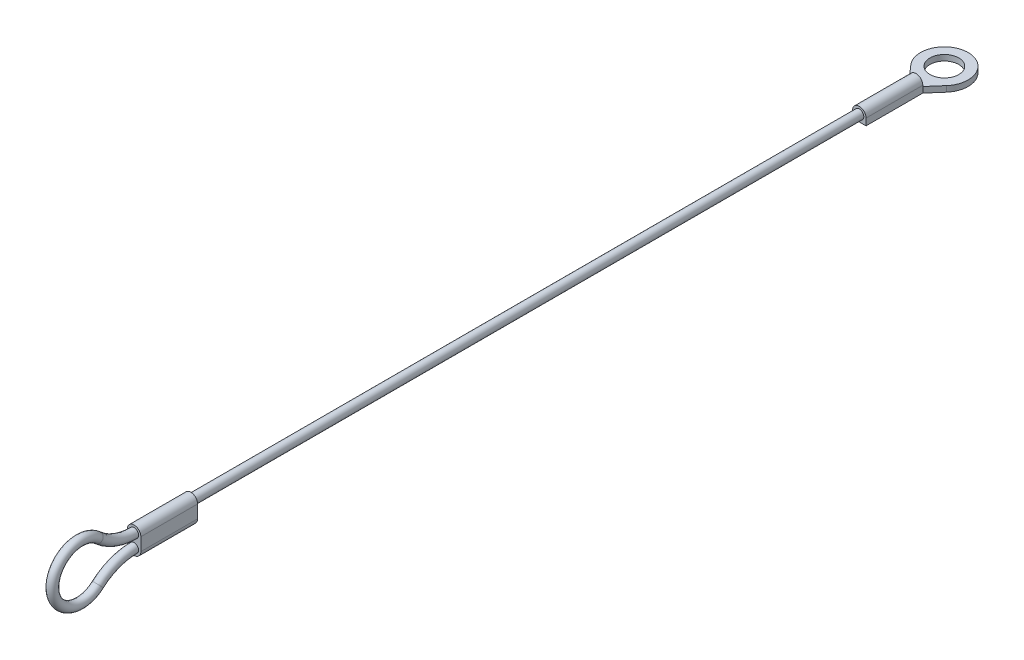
from build123d import *

# Parameters (mm, degrees)
SKETCH2_R           = 0.795
BOSS_EXTRUDE1_DEPTH = 10
BOSS_EXTRUDE2_DEPTH = 10
SKETCH5_R           = 2.54
BOSS_EXTRUDE3_DEPTH = 1.01


with BuildPart() as part:
    # Sweep1: sweep along a path in Sketch1
    with BuildLine(Plane(origin=(0, 0, 0), x_dir=(0, 0, -1), z_dir=(1, 0, 0))) as sweep1_path:
        Line((0, 0), (-127.8, 0))
        ThreePointArc((-127.8, 0), (-131.225492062, 0.631945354), (-134.2, 2.444582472))
        ThreePointArc((-134.2, 2.444582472), (-142.2, -1.133126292), (-134.2, -4.710835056))
        ThreePointArc((-134.2, -4.710835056), (-131.225492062, -2.898197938), (-127.8, -2.266252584))
    # Sketch2 → Sweep1 (sweep)
    with BuildSketch(Plane.XY):
        Circle(SKETCH2_R)
    sweep(path=sweep1_path.line)

    # Sketch3 → Boss-Extrude1 (add)
    with BuildSketch(Plane(origin=(0, 0, 127.8), x_dir=(-1, 0, 0), z_dir=(0, 0, -1))):
        with BuildLine():
            Line((1.195, 0), (1.195, -2.266252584))
            ThreePointArc((1.195, -2.266252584), (0, -3.461252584), (-1.195, -2.266252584))
            Line((-1.195, -2.266252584), (-1.195, 0))
            ThreePointArc((-1.195, 0), (0, 1.195), (1.195, 0))
        make_face()
    extrude(amount=BOSS_EXTRUDE1_DEPTH)

    # Sketch4 → Boss-Extrude2 (add)
    with BuildSketch(Plane(origin=(0, 0, 0), x_dir=(-1, 0, 0), z_dir=(0, 0, -1))):
        with BuildLine():
            Line((-1.195, 0), (-1.195, -1.195))
            Line((-1.195, -1.195), (0, -1.195))
            Line((0, -1.195), (1.195, -1.195))
            Line((1.195, -1.195), (1.195, 0))
            ThreePointArc((1.195, 0), (0, 1.195), (-1.195, 0))
        make_face()
    extrude(amount=BOSS_EXTRUDE2_DEPTH)

    # Sketch5 → Boss-Extrude3 (add)
    with BuildSketch(Plane.XZ.offset(1.195)):
        with BuildLine():
            Line((-1.195, -10), (1.195, -10))
            Line((1.195, -10), (3.155012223, -12.242827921))
            ThreePointArc((3.155012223, -12.242827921), (0, -19.19), (-3.155012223, -12.242827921))
            Line((-3.155012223, -12.242827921), (-1.195, -10))
        make_face()
        with Locations(Location((0, -15, 0), (0, 0, 270))):
            Circle(SKETCH5_R, mode=Mode.SUBTRACT)
    extrude(amount=-BOSS_EXTRUDE3_DEPTH)


solid = part.part
